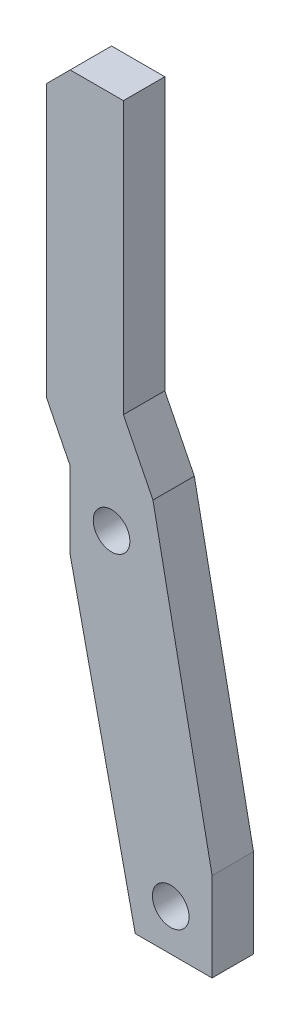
ISO-10303-21;
HEADER;
FILE_DESCRIPTION(('STEP AP214'),'2;1');
FILE_NAME('part.step','',(''),(''),'','','');
FILE_SCHEMA(('AUTOMOTIVE_DESIGN { 1 0 10303 214 1 1 1 1 }'));
ENDSEC;
DATA;
#1=APPLICATION_CONTEXT('core data for automotive mechanical design processes');
#2=APPLICATION_PROTOCOL_DEFINITION('international standard','automotive_design',2000,#1);
#3=PRODUCT_CONTEXT('',#1,'mechanical');
#4=PRODUCT('Part','Part','',(#3));
#5=PRODUCT_RELATED_PRODUCT_CATEGORY('part','',(#4));
#6=PRODUCT_DEFINITION_FORMATION('','',#4);
#7=PRODUCT_DEFINITION_CONTEXT('part definition',#1,'design');
#8=PRODUCT_DEFINITION('design','',#6,#7);
#9=PRODUCT_DEFINITION_SHAPE('','',#8);
#10=(LENGTH_UNIT() NAMED_UNIT(*) SI_UNIT(.MILLI.,.METRE.));
#11=(NAMED_UNIT(*) PLANE_ANGLE_UNIT() SI_UNIT($,.RADIAN.));
#12=(NAMED_UNIT(*) SI_UNIT($,.STERADIAN.) SOLID_ANGLE_UNIT());
#13=UNCERTAINTY_MEASURE_WITH_UNIT(LENGTH_MEASURE(1.E-05),#10,'distance_accuracy_value','');
#14=(GEOMETRIC_REPRESENTATION_CONTEXT(3) GLOBAL_UNCERTAINTY_ASSIGNED_CONTEXT((#13)) GLOBAL_UNIT_ASSIGNED_CONTEXT((#10,
#11,#12)) REPRESENTATION_CONTEXT('',''));
#15=CARTESIAN_POINT('',(0.,0.,0.));
#16=DIRECTION('',(0.,0.,1.));
#17=DIRECTION('',(1.,0.,0.));
#18=AXIS2_PLACEMENT_3D('',#15,#16,#17);
#19=CARTESIAN_POINT('',(7.0000000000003,8.00000000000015,-3.5));
#20=DIRECTION('',(1.,0.,0.));
#21=DIRECTION('',(0.,1.,0.));
#22=AXIS2_PLACEMENT_3D('',#19,#20,#21);
#23=PLANE('',#22);
#24=DIRECTION('',(0.,1.,0.));
#25=VECTOR('',#24,1.);
#26=CARTESIAN_POINT('',(7.0000000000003,8.00000000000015,3.5));
#27=LINE('',#26,#25);
#28=CARTESIAN_POINT('',(7.,-7.,3.5));
#29=VERTEX_POINT('',#28);
#30=CARTESIAN_POINT('',(7.0000000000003,8.00000000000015,3.5));
#31=VERTEX_POINT('',#30);
#32=EDGE_CURVE('E157',#29,#31,#27,.T.);
#33=ORIENTED_EDGE('',*,*,#32,.F.);
#34=DIRECTION('',(0.,0.,1.));
#35=VECTOR('',#34,1.);
#36=CARTESIAN_POINT('',(7.,-7.,-3.5));
#37=LINE('',#36,#35);
#38=CARTESIAN_POINT('',(7.,-7.,-3.5));
#39=VERTEX_POINT('',#38);
#40=EDGE_CURVE('E11',#39,#29,#37,.T.);
#41=ORIENTED_EDGE('',*,*,#40,.F.);
#42=DIRECTION('',(0.,1.,0.));
#43=VECTOR('',#42,1.);
#44=CARTESIAN_POINT('',(7.0000000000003,8.00000000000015,-3.5));
#45=LINE('',#44,#43);
#46=CARTESIAN_POINT('',(7.0000000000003,8.00000000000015,-3.5));
#47=VERTEX_POINT('',#46);
#48=EDGE_CURVE('E187',#39,#47,#45,.T.);
#49=ORIENTED_EDGE('',*,*,#48,.T.);
#50=DIRECTION('',(0.,0.,1.));
#51=VECTOR('',#50,1.);
#52=CARTESIAN_POINT('',(7.0000000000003,8.00000000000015,-3.5));
#53=LINE('',#52,#51);
#54=EDGE_CURVE('E106',#47,#31,#53,.T.);
#55=ORIENTED_EDGE('',*,*,#54,.T.);
#56=EDGE_LOOP('',(#33,#41,#49,#55));
#57=FACE_BOUND('',#56,.T.);
#58=ADVANCED_FACE('F41',(#57),#23,.T.);
#59=CARTESIAN_POINT('',(7.,-7.,-3.5));
#60=DIRECTION('',(0.,-1.,0.));
#61=DIRECTION('',(0.,0.,-1.));
#62=AXIS2_PLACEMENT_3D('',#59,#60,#61);
#63=PLANE('',#62);
#64=DIRECTION('',(1.,0.,0.));
#65=VECTOR('',#64,1.);
#66=CARTESIAN_POINT('',(7.,-7.,3.5));
#67=LINE('',#66,#65);
#68=CARTESIAN_POINT('',(-6.,-7.,3.5));
#69=VERTEX_POINT('',#68);
#70=EDGE_CURVE('E185',#69,#29,#67,.T.);
#71=ORIENTED_EDGE('',*,*,#70,.F.);
#72=DIRECTION('',(0.,0.,1.));
#73=VECTOR('',#72,1.);
#74=CARTESIAN_POINT('',(-6.,-7.,-3.5));
#75=LINE('',#74,#73);
#76=CARTESIAN_POINT('',(-6.,-7.,-3.5));
#77=VERTEX_POINT('',#76);
#78=EDGE_CURVE('E50',#77,#69,#75,.T.);
#79=ORIENTED_EDGE('',*,*,#78,.F.);
#80=DIRECTION('',(1.,0.,0.));
#81=VECTOR('',#80,1.);
#82=CARTESIAN_POINT('',(7.,-7.,-3.5));
#83=LINE('',#82,#81);
#84=EDGE_CURVE('E147',#77,#39,#83,.T.);
#85=ORIENTED_EDGE('',*,*,#84,.T.);
#86=ORIENTED_EDGE('',*,*,#40,.T.);
#87=EDGE_LOOP('',(#71,#79,#85,#86));
#88=FACE_BOUND('',#87,.T.);
#89=ADVANCED_FACE('F255',(#88),#63,.T.);
#90=CARTESIAN_POINT('',(-6.,-7.,-3.5));
#91=DIRECTION('',(-0.97664446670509,-0.214861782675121,0.));
#92=DIRECTION('',(0.214861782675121,-0.97664446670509,0.));
#93=AXIS2_PLACEMENT_3D('',#90,#91,#92);
#94=PLANE('',#93);
#95=DIRECTION('',(0.214861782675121,-0.97664446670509,0.));
#96=VECTOR('',#95,1.);
#97=CARTESIAN_POINT('',(-6.,-7.,3.5));
#98=LINE('',#97,#96);
#99=CARTESIAN_POINT('',(-17.,42.9999999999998,3.5));
#100=VERTEX_POINT('',#99);
#101=EDGE_CURVE('E134',#100,#69,#98,.T.);
#102=ORIENTED_EDGE('',*,*,#101,.F.);
#103=DIRECTION('',(0.,0.,1.));
#104=VECTOR('',#103,1.);
#105=CARTESIAN_POINT('',(-17.,42.9999999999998,-3.5));
#106=LINE('',#105,#104);
#107=CARTESIAN_POINT('',(-17.,42.9999999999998,-3.5));
#108=VERTEX_POINT('',#107);
#109=EDGE_CURVE('E129',#108,#100,#106,.T.);
#110=ORIENTED_EDGE('',*,*,#109,.F.);
#111=DIRECTION('',(0.214861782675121,-0.97664446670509,0.));
#112=VECTOR('',#111,1.);
#113=CARTESIAN_POINT('',(-6.,-7.,-3.5));
#114=LINE('',#113,#112);
#115=EDGE_CURVE('E132',#108,#77,#114,.T.);
#116=ORIENTED_EDGE('',*,*,#115,.T.);
#117=ORIENTED_EDGE('',*,*,#78,.T.);
#118=EDGE_LOOP('',(#102,#110,#116,#117));
#119=FACE_BOUND('',#118,.T.);
#120=ADVANCED_FACE('F131',(#119),#94,.T.);
#121=CARTESIAN_POINT('',(-17.,42.9999999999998,-3.5));
#122=DIRECTION('',(-1.,0.,0.));
#123=DIRECTION('',(0.,-1.,0.));
#124=AXIS2_PLACEMENT_3D('',#121,#122,#123);
#125=PLANE('',#124);
#126=DIRECTION('',(0.,-1.,0.));
#127=VECTOR('',#126,1.);
#128=CARTESIAN_POINT('',(-17.,42.9999999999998,3.5));
#129=LINE('',#128,#127);
#130=CARTESIAN_POINT('',(-17.,56.0000000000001,3.5));
#131=VERTEX_POINT('',#130);
#132=EDGE_CURVE('E182',#131,#100,#129,.T.);
#133=ORIENTED_EDGE('',*,*,#132,.F.);
#134=DIRECTION('',(0.,0.,1.));
#135=VECTOR('',#134,1.);
#136=CARTESIAN_POINT('',(-17.,56.0000000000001,-3.5));
#137=LINE('',#136,#135);
#138=CARTESIAN_POINT('',(-17.,56.0000000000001,-3.5));
#139=VERTEX_POINT('',#138);
#140=EDGE_CURVE('E139',#139,#131,#137,.T.);
#141=ORIENTED_EDGE('',*,*,#140,.F.);
#142=DIRECTION('',(0.,-1.,0.));
#143=VECTOR('',#142,1.);
#144=CARTESIAN_POINT('',(-17.,42.9999999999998,-3.5));
#145=LINE('',#144,#143);
#146=EDGE_CURVE('E145',#139,#108,#145,.T.);
#147=ORIENTED_EDGE('',*,*,#146,.T.);
#148=ORIENTED_EDGE('',*,*,#109,.T.);
#149=EDGE_LOOP('',(#133,#141,#147,#148));
#150=FACE_BOUND('',#149,.T.);
#151=ADVANCED_FACE('F149',(#150),#125,.T.);
#152=CARTESIAN_POINT('',(-17.,56.0000000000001,-3.5));
#153=DIRECTION('',(-0.894427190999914,-0.447213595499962,0.));
#154=DIRECTION('',(0.447213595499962,-0.894427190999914,0.));
#155=AXIS2_PLACEMENT_3D('',#152,#153,#154);
#156=PLANE('',#155);
#157=DIRECTION('',(0.447213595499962,-0.894427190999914,0.));
#158=VECTOR('',#157,1.);
#159=CARTESIAN_POINT('',(-17.,56.0000000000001,3.5));
#160=LINE('',#159,#158);
#161=CARTESIAN_POINT('',(-21.,64.,3.5));
#162=VERTEX_POINT('',#161);
#163=EDGE_CURVE('E179',#162,#131,#160,.T.);
#164=ORIENTED_EDGE('',*,*,#163,.F.);
#165=DIRECTION('',(0.,0.,1.));
#166=VECTOR('',#165,1.);
#167=CARTESIAN_POINT('',(-21.,64.,-3.5));
#168=LINE('',#167,#166);
#169=CARTESIAN_POINT('',(-21.,64.,-3.5));
#170=VERTEX_POINT('',#169);
#171=EDGE_CURVE('E191',#170,#162,#168,.T.);
#172=ORIENTED_EDGE('',*,*,#171,.F.);
#173=DIRECTION('',(0.447213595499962,-0.894427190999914,0.));
#174=VECTOR('',#173,1.);
#175=CARTESIAN_POINT('',(-17.,56.0000000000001,-3.5));
#176=LINE('',#175,#174);
#177=EDGE_CURVE('E150',#170,#139,#176,.T.);
#178=ORIENTED_EDGE('',*,*,#177,.T.);
#179=ORIENTED_EDGE('',*,*,#140,.T.);
#180=EDGE_LOOP('',(#164,#172,#178,#179));
#181=FACE_BOUND('',#180,.T.);
#182=ADVANCED_FACE('F268',(#181),#156,.T.);
#183=CARTESIAN_POINT('',(-21.,64.,-3.5));
#184=DIRECTION('',(-1.,0.,0.));
#185=DIRECTION('',(0.,0.,1.));
#186=AXIS2_PLACEMENT_3D('',#183,#184,#185);
#187=PLANE('',#186);
#188=DIRECTION('',(0.,-1.,0.));
#189=VECTOR('',#188,1.);
#190=CARTESIAN_POINT('',(-21.,64.,3.5));
#191=LINE('',#190,#189);
#192=CARTESIAN_POINT('',(-21.,110.,3.5));
#193=VERTEX_POINT('',#192);
#194=EDGE_CURVE('E176',#193,#162,#191,.T.);
#195=ORIENTED_EDGE('',*,*,#194,.F.);
#196=DIRECTION('',(0.,0.,1.));
#197=VECTOR('',#196,1.);
#198=CARTESIAN_POINT('',(-21.,110.,-3.5));
#199=LINE('',#198,#197);
#200=CARTESIAN_POINT('',(-21.,110.,-3.5));
#201=VERTEX_POINT('',#200);
#202=EDGE_CURVE('E193',#201,#193,#199,.T.);
#203=ORIENTED_EDGE('',*,*,#202,.F.);
#204=DIRECTION('',(0.,-1.,0.));
#205=VECTOR('',#204,1.);
#206=CARTESIAN_POINT('',(-21.,64.,-3.5));
#207=LINE('',#206,#205);
#208=EDGE_CURVE('E152',#201,#170,#207,.T.);
#209=ORIENTED_EDGE('',*,*,#208,.T.);
#210=ORIENTED_EDGE('',*,*,#171,.T.);
#211=EDGE_LOOP('',(#195,#203,#209,#210));
#212=FACE_BOUND('',#211,.T.);
#213=ADVANCED_FACE('F234',(#212),#187,.T.);
#214=CARTESIAN_POINT('',(-21.,110.,-3.5));
#215=DIRECTION('',(-0.707106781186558,0.707106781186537,0.));
#216=DIRECTION('',(-0.707106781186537,-0.707106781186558,0.));
#217=AXIS2_PLACEMENT_3D('',#214,#215,#216);
#218=PLANE('',#217);
#219=DIRECTION('',(-0.707106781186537,-0.707106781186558,0.));
#220=VECTOR('',#219,1.);
#221=CARTESIAN_POINT('',(-21.,110.,3.5));
#222=LINE('',#221,#220);
#223=CARTESIAN_POINT('',(-17.,114.,3.5));
#224=VERTEX_POINT('',#223);
#225=EDGE_CURVE('E173',#224,#193,#222,.T.);
#226=ORIENTED_EDGE('',*,*,#225,.F.);
#227=DIRECTION('',(0.,0.,1.));
#228=VECTOR('',#227,1.);
#229=CARTESIAN_POINT('',(-17.,114.,-3.5));
#230=LINE('',#229,#228);
#231=CARTESIAN_POINT('',(-17.,114.,-3.5));
#232=VERTEX_POINT('',#231);
#233=EDGE_CURVE('E195',#232,#224,#230,.T.);
#234=ORIENTED_EDGE('',*,*,#233,.F.);
#235=DIRECTION('',(-0.707106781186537,-0.707106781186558,0.));
#236=VECTOR('',#235,1.);
#237=CARTESIAN_POINT('',(-21.,110.,-3.5));
#238=LINE('',#237,#236);
#239=EDGE_CURVE('E228',#232,#201,#238,.T.);
#240=ORIENTED_EDGE('',*,*,#239,.T.);
#241=ORIENTED_EDGE('',*,*,#202,.T.);
#242=EDGE_LOOP('',(#226,#234,#240,#241));
#243=FACE_BOUND('',#242,.T.);
#244=ADVANCED_FACE('F240',(#243),#218,.T.);
#245=CARTESIAN_POINT('',(-17.,114.,-3.5));
#246=DIRECTION('',(0.,1.,0.));
#247=DIRECTION('',(0.,0.,1.));
#248=AXIS2_PLACEMENT_3D('',#245,#246,#247);
#249=PLANE('',#248);
#250=DIRECTION('',(-1.,0.,0.));
#251=VECTOR('',#250,1.);
#252=CARTESIAN_POINT('',(-17.,114.,3.5));
#253=LINE('',#252,#251);
#254=CARTESIAN_POINT('',(-8.,114.,3.5));
#255=VERTEX_POINT('',#254);
#256=EDGE_CURVE('E170',#255,#224,#253,.T.);
#257=ORIENTED_EDGE('',*,*,#256,.F.);
#258=DIRECTION('',(0.,0.,1.));
#259=VECTOR('',#258,1.);
#260=CARTESIAN_POINT('',(-8.,114.,-3.5));
#261=LINE('',#260,#259);
#262=CARTESIAN_POINT('',(-8.,114.,-3.5));
#263=VERTEX_POINT('',#262);
#264=EDGE_CURVE('E197',#263,#255,#261,.T.);
#265=ORIENTED_EDGE('',*,*,#264,.F.);
#266=DIRECTION('',(-1.,0.,0.));
#267=VECTOR('',#266,1.);
#268=CARTESIAN_POINT('',(-17.,114.,-3.5));
#269=LINE('',#268,#267);
#270=EDGE_CURVE('E225',#263,#232,#269,.T.);
#271=ORIENTED_EDGE('',*,*,#270,.T.);
#272=ORIENTED_EDGE('',*,*,#233,.T.);
#273=EDGE_LOOP('',(#257,#265,#271,#272));
#274=FACE_BOUND('',#273,.T.);
#275=ADVANCED_FACE('F243',(#274),#249,.T.);
#276=CARTESIAN_POINT('',(-8.,114.,-3.5));
#277=DIRECTION('',(1.,0.,0.));
#278=DIRECTION('',(0.,0.,-1.));
#279=AXIS2_PLACEMENT_3D('',#276,#277,#278);
#280=PLANE('',#279);
#281=DIRECTION('',(0.,1.,0.));
#282=VECTOR('',#281,1.);
#283=CARTESIAN_POINT('',(-8.,114.,3.5));
#284=LINE('',#283,#282);
#285=CARTESIAN_POINT('',(-8.,68.,3.5));
#286=VERTEX_POINT('',#285);
#287=EDGE_CURVE('E167',#286,#255,#284,.T.);
#288=ORIENTED_EDGE('',*,*,#287,.F.);
#289=DIRECTION('',(0.,0.,1.));
#290=VECTOR('',#289,1.);
#291=CARTESIAN_POINT('',(-8.,68.,-3.5));
#292=LINE('',#291,#290);
#293=CARTESIAN_POINT('',(-8.,68.,-3.5));
#294=VERTEX_POINT('',#293);
#295=EDGE_CURVE('E199',#294,#286,#292,.T.);
#296=ORIENTED_EDGE('',*,*,#295,.F.);
#297=DIRECTION('',(0.,1.,0.));
#298=VECTOR('',#297,1.);
#299=CARTESIAN_POINT('',(-8.,114.,-3.5));
#300=LINE('',#299,#298);
#301=EDGE_CURVE('E222',#294,#263,#300,.T.);
#302=ORIENTED_EDGE('',*,*,#301,.T.);
#303=ORIENTED_EDGE('',*,*,#264,.T.);
#304=EDGE_LOOP('',(#288,#296,#302,#303));
#305=FACE_BOUND('',#304,.T.);
#306=ADVANCED_FACE('F248',(#305),#280,.T.);
#307=CARTESIAN_POINT('',(-8.,68.,-3.5));
#308=DIRECTION('',(0.894427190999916,0.447213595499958,0.));
#309=DIRECTION('',(-0.447213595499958,0.894427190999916,0.));
#310=AXIS2_PLACEMENT_3D('',#307,#308,#309);
#311=PLANE('',#310);
#312=DIRECTION('',(-0.447213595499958,0.894427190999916,0.));
#313=VECTOR('',#312,1.);
#314=CARTESIAN_POINT('',(-8.,68.,3.5));
#315=LINE('',#314,#313);
#316=CARTESIAN_POINT('',(-3.,58.,3.5));
#317=VERTEX_POINT('',#316);
#318=EDGE_CURVE('E164',#317,#286,#315,.T.);
#319=ORIENTED_EDGE('',*,*,#318,.F.);
#320=DIRECTION('',(0.,0.,1.));
#321=VECTOR('',#320,1.);
#322=CARTESIAN_POINT('',(-3.,58.,-3.5));
#323=LINE('',#322,#321);
#324=CARTESIAN_POINT('',(-3.,58.,-3.5));
#325=VERTEX_POINT('',#324);
#326=EDGE_CURVE('E201',#325,#317,#323,.T.);
#327=ORIENTED_EDGE('',*,*,#326,.F.);
#328=DIRECTION('',(-0.447213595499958,0.894427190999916,0.));
#329=VECTOR('',#328,1.);
#330=CARTESIAN_POINT('',(-8.,68.,-3.5));
#331=LINE('',#330,#329);
#332=EDGE_CURVE('E219',#325,#294,#331,.T.);
#333=ORIENTED_EDGE('',*,*,#332,.T.);
#334=ORIENTED_EDGE('',*,*,#295,.T.);
#335=EDGE_LOOP('',(#319,#327,#333,#334));
#336=FACE_BOUND('',#335,.T.);
#337=ADVANCED_FACE('F251',(#336),#311,.T.);
#338=CARTESIAN_POINT('',(-3.,58.,-3.5));
#339=DIRECTION('',(0.980580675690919,0.19611613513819,0.));
#340=DIRECTION('',(-0.19611613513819,0.980580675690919,0.));
#341=AXIS2_PLACEMENT_3D('',#338,#339,#340);
#342=PLANE('',#341);
#343=DIRECTION('',(-0.19611613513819,0.980580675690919,0.));
#344=VECTOR('',#343,1.);
#345=CARTESIAN_POINT('',(-3.,58.,3.5));
#346=LINE('',#345,#344);
#347=EDGE_CURVE('E160',#31,#317,#346,.T.);
#348=ORIENTED_EDGE('',*,*,#347,.F.);
#349=ORIENTED_EDGE('',*,*,#54,.F.);
#350=DIRECTION('',(-0.19611613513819,0.980580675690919,0.));
#351=VECTOR('',#350,1.);
#352=CARTESIAN_POINT('',(-3.,58.,-3.5));
#353=LINE('',#352,#351);
#354=EDGE_CURVE('E217',#47,#325,#353,.T.);
#355=ORIENTED_EDGE('',*,*,#354,.T.);
#356=ORIENTED_EDGE('',*,*,#326,.T.);
#357=EDGE_LOOP('',(#348,#349,#355,#356));
#358=FACE_BOUND('',#357,.T.);
#359=ADVANCED_FACE('F252',(#358),#342,.T.);
#360=CARTESIAN_POINT('',(0.,0.,-3.5));
#361=DIRECTION('',(0.,0.,-1.));
#362=DIRECTION('',(-1.,0.,0.));
#363=AXIS2_PLACEMENT_3D('',#360,#361,#362);
#364=PLANE('',#363);
#365=CARTESIAN_POINT('',(0.,0.,-3.5));
#366=DIRECTION('',(0.,0.,-1.));
#367=DIRECTION('',(-1.,0.,0.));
#368=AXIS2_PLACEMENT_3D('',#365,#366,#367);
#369=CIRCLE('',#368,3.1);
#370=CARTESIAN_POINT('',(-3.1,0.,-3.5));
#371=VERTEX_POINT('',#370);
#372=EDGE_CURVE('E161',#371,#371,#369,.T.);
#373=ORIENTED_EDGE('',*,*,#372,.F.);
#374=EDGE_LOOP('',(#373));
#375=FACE_BOUND('',#374,.T.);
#376=CARTESIAN_POINT('',(-10.,50.,-3.5));
#377=DIRECTION('',(0.,0.,-1.));
#378=DIRECTION('',(-1.,0.,0.));
#379=AXIS2_PLACEMENT_3D('',#376,#377,#378);
#380=CIRCLE('',#379,3.1);
#381=CARTESIAN_POINT('',(-13.1,50.,-3.5));
#382=VERTEX_POINT('',#381);
#383=EDGE_CURVE('E205',#382,#382,#380,.T.);
#384=ORIENTED_EDGE('',*,*,#383,.F.);
#385=EDGE_LOOP('',(#384));
#386=FACE_BOUND('',#385,.T.);
#387=ORIENTED_EDGE('',*,*,#48,.F.);
#388=ORIENTED_EDGE('',*,*,#84,.F.);
#389=ORIENTED_EDGE('',*,*,#115,.F.);
#390=ORIENTED_EDGE('',*,*,#146,.F.);
#391=ORIENTED_EDGE('',*,*,#177,.F.);
#392=ORIENTED_EDGE('',*,*,#208,.F.);
#393=ORIENTED_EDGE('',*,*,#239,.F.);
#394=ORIENTED_EDGE('',*,*,#270,.F.);
#395=ORIENTED_EDGE('',*,*,#301,.F.);
#396=ORIENTED_EDGE('',*,*,#332,.F.);
#397=ORIENTED_EDGE('',*,*,#354,.F.);
#398=EDGE_LOOP('',(#387,#388,#389,#390,#391,#392,#393,#394,#395,#396,#397));
#399=FACE_BOUND('',#398,.T.);
#400=ADVANCED_FACE('F143',(#375,#386,#399),#364,.T.);
#401=CARTESIAN_POINT('',(0.,0.,3.5));
#402=DIRECTION('',(0.,0.,-1.));
#403=DIRECTION('',(-1.,0.,0.));
#404=AXIS2_PLACEMENT_3D('',#401,#402,#403);
#405=PLANE('',#404);
#406=CARTESIAN_POINT('',(0.,0.,3.5));
#407=DIRECTION('',(0.,0.,-1.));
#408=DIRECTION('',(-1.,0.,0.));
#409=AXIS2_PLACEMENT_3D('',#406,#407,#408);
#410=CIRCLE('',#409,3.1);
#411=CARTESIAN_POINT('',(-3.1,0.,3.5));
#412=VERTEX_POINT('',#411);
#413=EDGE_CURVE('E44',#412,#412,#410,.T.);
#414=ORIENTED_EDGE('',*,*,#413,.T.);
#415=EDGE_LOOP('',(#414));
#416=FACE_BOUND('',#415,.T.);
#417=CARTESIAN_POINT('',(-10.,50.,3.5));
#418=DIRECTION('',(0.,0.,-1.));
#419=DIRECTION('',(-1.,0.,0.));
#420=AXIS2_PLACEMENT_3D('',#417,#418,#419);
#421=CIRCLE('',#420,3.1);
#422=CARTESIAN_POINT('',(-13.1,50.,3.5));
#423=VERTEX_POINT('',#422);
#424=EDGE_CURVE('E203',#423,#423,#421,.T.);
#425=ORIENTED_EDGE('',*,*,#424,.T.);
#426=EDGE_LOOP('',(#425));
#427=FACE_BOUND('',#426,.T.);
#428=ORIENTED_EDGE('',*,*,#32,.T.);
#429=ORIENTED_EDGE('',*,*,#347,.T.);
#430=ORIENTED_EDGE('',*,*,#318,.T.);
#431=ORIENTED_EDGE('',*,*,#287,.T.);
#432=ORIENTED_EDGE('',*,*,#256,.T.);
#433=ORIENTED_EDGE('',*,*,#225,.T.);
#434=ORIENTED_EDGE('',*,*,#194,.T.);
#435=ORIENTED_EDGE('',*,*,#163,.T.);
#436=ORIENTED_EDGE('',*,*,#132,.T.);
#437=ORIENTED_EDGE('',*,*,#101,.T.);
#438=ORIENTED_EDGE('',*,*,#70,.T.);
#439=EDGE_LOOP('',(#428,#429,#430,#431,#432,#433,#434,#435,#436,#437,#438));
#440=FACE_BOUND('',#439,.T.);
#441=ADVANCED_FACE('F254',(#416,#427,#440),#405,.F.);
#442=CARTESIAN_POINT('',(-10.,50.,-250.));
#443=DIRECTION('',(0.,0.,1.));
#444=DIRECTION('',(1.,0.,0.));
#445=AXIS2_PLACEMENT_3D('',#442,#443,#444);
#446=CYLINDRICAL_SURFACE('',#445,3.1);
#447=ORIENTED_EDGE('',*,*,#383,.T.);
#448=EDGE_LOOP('',(#447));
#449=FACE_BOUND('',#448,.T.);
#450=ORIENTED_EDGE('',*,*,#424,.F.);
#451=EDGE_LOOP('',(#450));
#452=FACE_BOUND('',#451,.T.);
#453=ADVANCED_FACE('F289',(#449,#452),#446,.F.);
#454=CARTESIAN_POINT('',(0.,0.,-250.));
#455=DIRECTION('',(0.,0.,1.));
#456=DIRECTION('',(1.,0.,0.));
#457=AXIS2_PLACEMENT_3D('',#454,#455,#456);
#458=CYLINDRICAL_SURFACE('',#457,3.1);
#459=ORIENTED_EDGE('',*,*,#372,.T.);
#460=EDGE_LOOP('',(#459));
#461=FACE_BOUND('',#460,.T.);
#462=ORIENTED_EDGE('',*,*,#413,.F.);
#463=EDGE_LOOP('',(#462));
#464=FACE_BOUND('',#463,.T.);
#465=ADVANCED_FACE('F296',(#461,#464),#458,.F.);
#466=CLOSED_SHELL('',(#58,#89,#120,#151,#182,#213,#244,#275,#306,#337,#359,#400,#441,#453,#465));
#467=MANIFOLD_SOLID_BREP('B2',#466);
#468=ADVANCED_BREP_SHAPE_REPRESENTATION('',(#18,#467),#14);
#469=SHAPE_DEFINITION_REPRESENTATION(#9,#468);
ENDSEC;
END-ISO-10303-21;
